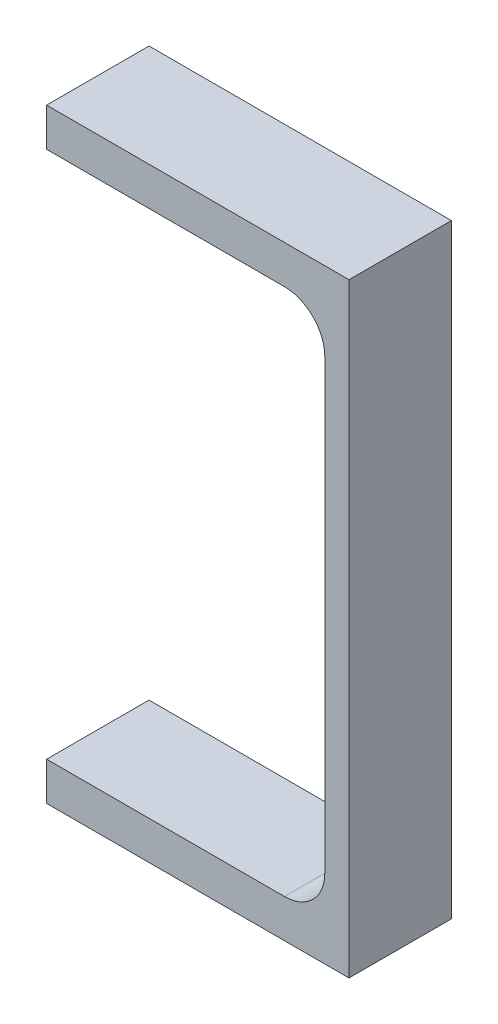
ISO-10303-21;
HEADER;
FILE_DESCRIPTION(('STEP AP214'),'2;1');
FILE_NAME('part.step','',(''),(''),'','','');
FILE_SCHEMA(('AUTOMOTIVE_DESIGN { 1 0 10303 214 1 1 1 1 }'));
ENDSEC;
DATA;
#1=APPLICATION_CONTEXT('core data for automotive mechanical design processes');
#2=APPLICATION_PROTOCOL_DEFINITION('international standard','automotive_design',2000,#1);
#3=PRODUCT_CONTEXT('',#1,'mechanical');
#4=PRODUCT('Part','Part','',(#3));
#5=PRODUCT_RELATED_PRODUCT_CATEGORY('part','',(#4));
#6=PRODUCT_DEFINITION_FORMATION('','',#4);
#7=PRODUCT_DEFINITION_CONTEXT('part definition',#1,'design');
#8=PRODUCT_DEFINITION('design','',#6,#7);
#9=PRODUCT_DEFINITION_SHAPE('','',#8);
#10=(LENGTH_UNIT() NAMED_UNIT(*) SI_UNIT(.MILLI.,.METRE.));
#11=(NAMED_UNIT(*) PLANE_ANGLE_UNIT() SI_UNIT($,.RADIAN.));
#12=(NAMED_UNIT(*) SI_UNIT($,.STERADIAN.) SOLID_ANGLE_UNIT());
#13=UNCERTAINTY_MEASURE_WITH_UNIT(LENGTH_MEASURE(1.E-05),#10,'distance_accuracy_value','');
#14=(GEOMETRIC_REPRESENTATION_CONTEXT(3) GLOBAL_UNCERTAINTY_ASSIGNED_CONTEXT((#13)) GLOBAL_UNIT_ASSIGNED_CONTEXT((#10,
#11,#12)) REPRESENTATION_CONTEXT('',''));
#15=CARTESIAN_POINT('',(0.,0.,0.));
#16=DIRECTION('',(0.,0.,1.));
#17=DIRECTION('',(1.,0.,0.));
#18=AXIS2_PLACEMENT_3D('',#15,#16,#17);
#19=CARTESIAN_POINT('',(-75.,75.,12.7));
#20=DIRECTION('',(1.,0.,0.));
#21=DIRECTION('',(0.,1.,0.));
#22=AXIS2_PLACEMENT_3D('',#19,#20,#21);
#23=PLANE('',#22);
#24=DIRECTION('',(0.,-1.,0.));
#25=VECTOR('',#24,1.);
#26=CARTESIAN_POINT('',(-75.,75.,-12.7));
#27=LINE('',#26,#25);
#28=CARTESIAN_POINT('',(-75.,75.,-12.7));
#29=VERTEX_POINT('',#28);
#30=CARTESIAN_POINT('',(-75.,65.5,-12.7));
#31=VERTEX_POINT('',#30);
#32=EDGE_CURVE('E141',#29,#31,#27,.T.);
#33=ORIENTED_EDGE('',*,*,#32,.T.);
#34=DIRECTION('',(0.,0.,-1.));
#35=VECTOR('',#34,1.);
#36=CARTESIAN_POINT('',(-75.,65.5,12.7));
#37=LINE('',#36,#35);
#38=CARTESIAN_POINT('',(-75.,65.5,12.7));
#39=VERTEX_POINT('',#38);
#40=EDGE_CURVE('E11',#39,#31,#37,.T.);
#41=ORIENTED_EDGE('',*,*,#40,.F.);
#42=DIRECTION('',(0.,-1.,0.));
#43=VECTOR('',#42,1.);
#44=CARTESIAN_POINT('',(-75.,75.,12.7));
#45=LINE('',#44,#43);
#46=CARTESIAN_POINT('',(-75.,75.,12.7));
#47=VERTEX_POINT('',#46);
#48=EDGE_CURVE('E159',#47,#39,#45,.T.);
#49=ORIENTED_EDGE('',*,*,#48,.F.);
#50=DIRECTION('',(0.,0.,-1.));
#51=VECTOR('',#50,1.);
#52=CARTESIAN_POINT('',(-75.,75.,12.7));
#53=LINE('',#52,#51);
#54=EDGE_CURVE('E137',#47,#29,#53,.T.);
#55=ORIENTED_EDGE('',*,*,#54,.T.);
#56=EDGE_LOOP('',(#33,#41,#49,#55));
#57=FACE_BOUND('',#56,.T.);
#58=ADVANCED_FACE('F33',(#57),#23,.F.);
#59=CARTESIAN_POINT('',(-75.,65.5,12.7));
#60=DIRECTION('',(0.,1.,0.));
#61=DIRECTION('',(-1.,0.,0.));
#62=AXIS2_PLACEMENT_3D('',#59,#60,#61);
#63=PLANE('',#62);
#64=DIRECTION('',(1.,0.,0.));
#65=VECTOR('',#64,1.);
#66=CARTESIAN_POINT('',(-75.,65.5,-12.7));
#67=LINE('',#66,#65);
#68=CARTESIAN_POINT('',(-16.,65.5,-12.7));
#69=VERTEX_POINT('',#68);
#70=EDGE_CURVE('E144',#31,#69,#67,.T.);
#71=ORIENTED_EDGE('',*,*,#70,.T.);
#72=DIRECTION('',(0.,0.,-1.));
#73=VECTOR('',#72,1.);
#74=CARTESIAN_POINT('',(-16.,65.5,12.7));
#75=LINE('',#74,#73);
#76=CARTESIAN_POINT('',(-16.,65.5,12.7));
#77=VERTEX_POINT('',#76);
#78=EDGE_CURVE('E41',#77,#69,#75,.T.);
#79=ORIENTED_EDGE('',*,*,#78,.F.);
#80=DIRECTION('',(1.,0.,0.));
#81=VECTOR('',#80,1.);
#82=CARTESIAN_POINT('',(-75.,65.5,12.7));
#83=LINE('',#82,#81);
#84=EDGE_CURVE('E98',#39,#77,#83,.T.);
#85=ORIENTED_EDGE('',*,*,#84,.F.);
#86=ORIENTED_EDGE('',*,*,#40,.T.);
#87=EDGE_LOOP('',(#71,#79,#85,#86));
#88=FACE_BOUND('',#87,.T.);
#89=ADVANCED_FACE('F208',(#88),#63,.F.);
#90=CARTESIAN_POINT('',(-16.,55.5,12.7));
#91=DIRECTION('',(0.,0.,-1.));
#92=DIRECTION('',(-1.,0.,0.));
#93=AXIS2_PLACEMENT_3D('',#90,#91,#92);
#94=CYLINDRICAL_SURFACE('',#93,10.);
#95=CARTESIAN_POINT('',(-16.,55.5,-12.7));
#96=DIRECTION('',(0.,0.,-1.));
#97=DIRECTION('',(-1.,0.,0.));
#98=AXIS2_PLACEMENT_3D('',#95,#96,#97);
#99=CIRCLE('',#98,10.);
#100=CARTESIAN_POINT('',(-5.99999999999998,55.5,-12.7));
#101=VERTEX_POINT('',#100);
#102=EDGE_CURVE('E146',#69,#101,#99,.T.);
#103=ORIENTED_EDGE('',*,*,#102,.T.);
#104=DIRECTION('',(0.,0.,-1.));
#105=VECTOR('',#104,1.);
#106=CARTESIAN_POINT('',(-5.99999999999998,55.5,12.7));
#107=LINE('',#106,#105);
#108=CARTESIAN_POINT('',(-5.99999999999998,55.5,12.7));
#109=VERTEX_POINT('',#108);
#110=EDGE_CURVE('E172',#109,#101,#107,.T.);
#111=ORIENTED_EDGE('',*,*,#110,.F.);
#112=CARTESIAN_POINT('',(-16.,55.5,12.7));
#113=DIRECTION('',(0.,0.,-1.));
#114=DIRECTION('',(-1.,0.,0.));
#115=AXIS2_PLACEMENT_3D('',#112,#113,#114);
#116=CIRCLE('',#115,10.);
#117=EDGE_CURVE('E180',#77,#109,#116,.T.);
#118=ORIENTED_EDGE('',*,*,#117,.F.);
#119=ORIENTED_EDGE('',*,*,#78,.T.);
#120=EDGE_LOOP('',(#103,#111,#118,#119));
#121=FACE_BOUND('',#120,.T.);
#122=ADVANCED_FACE('F178',(#121),#94,.F.);
#123=CARTESIAN_POINT('',(-5.99999999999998,55.5,12.7));
#124=DIRECTION('',(1.,0.,0.));
#125=DIRECTION('',(0.,0.,-1.));
#126=AXIS2_PLACEMENT_3D('',#123,#124,#125);
#127=PLANE('',#126);
#128=DIRECTION('',(0.,-1.,0.));
#129=VECTOR('',#128,1.);
#130=CARTESIAN_POINT('',(-5.99999999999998,55.5,-12.7));
#131=LINE('',#130,#129);
#132=CARTESIAN_POINT('',(-5.99999999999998,-55.5,-12.7));
#133=VERTEX_POINT('',#132);
#134=EDGE_CURVE('E148',#101,#133,#131,.T.);
#135=ORIENTED_EDGE('',*,*,#134,.T.);
#136=DIRECTION('',(0.,0.,-1.));
#137=VECTOR('',#136,1.);
#138=CARTESIAN_POINT('',(-5.99999999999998,-55.5,12.7));
#139=LINE('',#138,#137);
#140=CARTESIAN_POINT('',(-5.99999999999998,-55.5,12.7));
#141=VERTEX_POINT('',#140);
#142=EDGE_CURVE('E169',#141,#133,#139,.T.);
#143=ORIENTED_EDGE('',*,*,#142,.F.);
#144=DIRECTION('',(0.,-1.,0.));
#145=VECTOR('',#144,1.);
#146=CARTESIAN_POINT('',(-5.99999999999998,55.5,12.7));
#147=LINE('',#146,#145);
#148=EDGE_CURVE('E198',#109,#141,#147,.T.);
#149=ORIENTED_EDGE('',*,*,#148,.F.);
#150=ORIENTED_EDGE('',*,*,#110,.T.);
#151=EDGE_LOOP('',(#135,#143,#149,#150));
#152=FACE_BOUND('',#151,.T.);
#153=ADVANCED_FACE('F189',(#152),#127,.F.);
#154=CARTESIAN_POINT('',(-16.,-55.5,12.7));
#155=DIRECTION('',(0.,0.,-1.));
#156=DIRECTION('',(-1.,0.,0.));
#157=AXIS2_PLACEMENT_3D('',#154,#155,#156);
#158=CYLINDRICAL_SURFACE('',#157,10.);
#159=CARTESIAN_POINT('',(-16.,-55.5,-12.7));
#160=DIRECTION('',(0.,0.,-1.));
#161=DIRECTION('',(1.,0.,0.));
#162=AXIS2_PLACEMENT_3D('',#159,#160,#161);
#163=CIRCLE('',#162,10.);
#164=CARTESIAN_POINT('',(-16.,-65.5,-12.7));
#165=VERTEX_POINT('',#164);
#166=EDGE_CURVE('E150',#133,#165,#163,.T.);
#167=ORIENTED_EDGE('',*,*,#166,.T.);
#168=DIRECTION('',(0.,0.,-1.));
#169=VECTOR('',#168,1.);
#170=CARTESIAN_POINT('',(-16.,-65.5,12.7));
#171=LINE('',#170,#169);
#172=CARTESIAN_POINT('',(-16.,-65.5,12.7));
#173=VERTEX_POINT('',#172);
#174=EDGE_CURVE('E166',#173,#165,#171,.T.);
#175=ORIENTED_EDGE('',*,*,#174,.F.);
#176=CARTESIAN_POINT('',(-16.,-55.5,12.7));
#177=DIRECTION('',(0.,0.,-1.));
#178=DIRECTION('',(1.,0.,0.));
#179=AXIS2_PLACEMENT_3D('',#176,#177,#178);
#180=CIRCLE('',#179,10.);
#181=EDGE_CURVE('E195',#141,#173,#180,.T.);
#182=ORIENTED_EDGE('',*,*,#181,.F.);
#183=ORIENTED_EDGE('',*,*,#142,.T.);
#184=EDGE_LOOP('',(#167,#175,#182,#183));
#185=FACE_BOUND('',#184,.T.);
#186=ADVANCED_FACE('F193',(#185),#158,.F.);
#187=CARTESIAN_POINT('',(-75.,-65.5,12.7));
#188=DIRECTION('',(0.,-1.,0.));
#189=DIRECTION('',(1.,0.,0.));
#190=AXIS2_PLACEMENT_3D('',#187,#188,#189);
#191=PLANE('',#190);
#192=DIRECTION('',(-1.,0.,0.));
#193=VECTOR('',#192,1.);
#194=CARTESIAN_POINT('',(-75.,-65.5,-12.7));
#195=LINE('',#194,#193);
#196=CARTESIAN_POINT('',(-75.,-65.5,-12.7));
#197=VERTEX_POINT('',#196);
#198=EDGE_CURVE('E152',#165,#197,#195,.T.);
#199=ORIENTED_EDGE('',*,*,#198,.T.);
#200=DIRECTION('',(0.,0.,-1.));
#201=VECTOR('',#200,1.);
#202=CARTESIAN_POINT('',(-75.,-65.5,12.7));
#203=LINE('',#202,#201);
#204=CARTESIAN_POINT('',(-75.,-65.5,12.7));
#205=VERTEX_POINT('',#204);
#206=EDGE_CURVE('E163',#205,#197,#203,.T.);
#207=ORIENTED_EDGE('',*,*,#206,.F.);
#208=DIRECTION('',(-1.,0.,0.));
#209=VECTOR('',#208,1.);
#210=CARTESIAN_POINT('',(-75.,-65.5,12.7));
#211=LINE('',#210,#209);
#212=EDGE_CURVE('E197',#173,#205,#211,.T.);
#213=ORIENTED_EDGE('',*,*,#212,.F.);
#214=ORIENTED_EDGE('',*,*,#174,.T.);
#215=EDGE_LOOP('',(#199,#207,#213,#214));
#216=FACE_BOUND('',#215,.T.);
#217=ADVANCED_FACE('F220',(#216),#191,.F.);
#218=CARTESIAN_POINT('',(-75.,-65.5,12.7));
#219=DIRECTION('',(1.,0.,0.));
#220=DIRECTION('',(0.,1.,0.));
#221=AXIS2_PLACEMENT_3D('',#218,#219,#220);
#222=PLANE('',#221);
#223=DIRECTION('',(0.,-1.,0.));
#224=VECTOR('',#223,1.);
#225=CARTESIAN_POINT('',(-75.,-65.5,-12.7));
#226=LINE('',#225,#224);
#227=CARTESIAN_POINT('',(-75.,-75.,-12.7));
#228=VERTEX_POINT('',#227);
#229=EDGE_CURVE('E154',#197,#228,#226,.T.);
#230=ORIENTED_EDGE('',*,*,#229,.T.);
#231=DIRECTION('',(0.,0.,-1.));
#232=VECTOR('',#231,1.);
#233=CARTESIAN_POINT('',(-75.,-75.,12.7));
#234=LINE('',#233,#232);
#235=CARTESIAN_POINT('',(-75.,-75.,12.7));
#236=VERTEX_POINT('',#235);
#237=EDGE_CURVE('E132',#236,#228,#234,.T.);
#238=ORIENTED_EDGE('',*,*,#237,.F.);
#239=DIRECTION('',(0.,-1.,0.));
#240=VECTOR('',#239,1.);
#241=CARTESIAN_POINT('',(-75.,-65.5,12.7));
#242=LINE('',#241,#240);
#243=EDGE_CURVE('E123',#205,#236,#242,.T.);
#244=ORIENTED_EDGE('',*,*,#243,.F.);
#245=ORIENTED_EDGE('',*,*,#206,.T.);
#246=EDGE_LOOP('',(#230,#238,#244,#245));
#247=FACE_BOUND('',#246,.T.);
#248=ADVANCED_FACE('F223',(#247),#222,.F.);
#249=CARTESIAN_POINT('',(-75.,-75.,12.7));
#250=DIRECTION('',(0.,1.,0.));
#251=DIRECTION('',(-1.,0.,0.));
#252=AXIS2_PLACEMENT_3D('',#249,#250,#251);
#253=PLANE('',#252);
#254=DIRECTION('',(1.,0.,0.));
#255=VECTOR('',#254,1.);
#256=CARTESIAN_POINT('',(-75.,-75.,-12.7));
#257=LINE('',#256,#255);
#258=CARTESIAN_POINT('',(0.,-75.,-12.7));
#259=VERTEX_POINT('',#258);
#260=EDGE_CURVE('E131',#228,#259,#257,.T.);
#261=ORIENTED_EDGE('',*,*,#260,.T.);
#262=DIRECTION('',(0.,0.,-1.));
#263=VECTOR('',#262,1.);
#264=CARTESIAN_POINT('',(0.,-75.,12.7));
#265=LINE('',#264,#263);
#266=CARTESIAN_POINT('',(0.,-75.,12.7));
#267=VERTEX_POINT('',#266);
#268=EDGE_CURVE('E128',#267,#259,#265,.T.);
#269=ORIENTED_EDGE('',*,*,#268,.F.);
#270=DIRECTION('',(1.,0.,0.));
#271=VECTOR('',#270,1.);
#272=CARTESIAN_POINT('',(-75.,-75.,12.7));
#273=LINE('',#272,#271);
#274=EDGE_CURVE('E117',#236,#267,#273,.T.);
#275=ORIENTED_EDGE('',*,*,#274,.F.);
#276=ORIENTED_EDGE('',*,*,#237,.T.);
#277=EDGE_LOOP('',(#261,#269,#275,#276));
#278=FACE_BOUND('',#277,.T.);
#279=ADVANCED_FACE('F129',(#278),#253,.F.);
#280=CARTESIAN_POINT('',(0.,75.,12.7));
#281=DIRECTION('',(-1.,0.,0.));
#282=DIRECTION('',(0.,0.,1.));
#283=AXIS2_PLACEMENT_3D('',#280,#281,#282);
#284=PLANE('',#283);
#285=DIRECTION('',(0.,1.,0.));
#286=VECTOR('',#285,1.);
#287=CARTESIAN_POINT('',(0.,75.,-12.7));
#288=LINE('',#287,#286);
#289=CARTESIAN_POINT('',(0.,75.,-12.7));
#290=VERTEX_POINT('',#289);
#291=EDGE_CURVE('E84',#259,#290,#288,.T.);
#292=ORIENTED_EDGE('',*,*,#291,.T.);
#293=DIRECTION('',(0.,0.,-1.));
#294=VECTOR('',#293,1.);
#295=CARTESIAN_POINT('',(0.,75.,12.7));
#296=LINE('',#295,#294);
#297=CARTESIAN_POINT('',(0.,75.,12.7));
#298=VERTEX_POINT('',#297);
#299=EDGE_CURVE('E133',#298,#290,#296,.T.);
#300=ORIENTED_EDGE('',*,*,#299,.F.);
#301=DIRECTION('',(0.,1.,0.));
#302=VECTOR('',#301,1.);
#303=CARTESIAN_POINT('',(0.,75.,12.7));
#304=LINE('',#303,#302);
#305=EDGE_CURVE('E121',#267,#298,#304,.T.);
#306=ORIENTED_EDGE('',*,*,#305,.F.);
#307=ORIENTED_EDGE('',*,*,#268,.T.);
#308=EDGE_LOOP('',(#292,#300,#306,#307));
#309=FACE_BOUND('',#308,.T.);
#310=ADVANCED_FACE('F135',(#309),#284,.F.);
#311=CARTESIAN_POINT('',(-75.,75.,12.7));
#312=DIRECTION('',(0.,-1.,0.));
#313=DIRECTION('',(1.,0.,0.));
#314=AXIS2_PLACEMENT_3D('',#311,#312,#313);
#315=PLANE('',#314);
#316=DIRECTION('',(-1.,0.,0.));
#317=VECTOR('',#316,1.);
#318=CARTESIAN_POINT('',(-75.,75.,-12.7));
#319=LINE('',#318,#317);
#320=EDGE_CURVE('E90',#290,#29,#319,.T.);
#321=ORIENTED_EDGE('',*,*,#320,.T.);
#322=ORIENTED_EDGE('',*,*,#54,.F.);
#323=DIRECTION('',(-1.,0.,0.));
#324=VECTOR('',#323,1.);
#325=CARTESIAN_POINT('',(-75.,75.,12.7));
#326=LINE('',#325,#324);
#327=EDGE_CURVE('E49',#298,#47,#326,.T.);
#328=ORIENTED_EDGE('',*,*,#327,.F.);
#329=ORIENTED_EDGE('',*,*,#299,.T.);
#330=EDGE_LOOP('',(#321,#322,#328,#329));
#331=FACE_BOUND('',#330,.T.);
#332=ADVANCED_FACE('F232',(#331),#315,.F.);
#333=CARTESIAN_POINT('',(-16.,55.5,12.7));
#334=DIRECTION('',(0.,0.,-1.));
#335=DIRECTION('',(-1.,0.,0.));
#336=AXIS2_PLACEMENT_3D('',#333,#334,#335);
#337=PLANE('',#336);
#338=ORIENTED_EDGE('',*,*,#48,.T.);
#339=ORIENTED_EDGE('',*,*,#84,.T.);
#340=ORIENTED_EDGE('',*,*,#117,.T.);
#341=ORIENTED_EDGE('',*,*,#148,.T.);
#342=ORIENTED_EDGE('',*,*,#181,.T.);
#343=ORIENTED_EDGE('',*,*,#212,.T.);
#344=ORIENTED_EDGE('',*,*,#243,.T.);
#345=ORIENTED_EDGE('',*,*,#274,.T.);
#346=ORIENTED_EDGE('',*,*,#305,.T.);
#347=ORIENTED_EDGE('',*,*,#327,.T.);
#348=EDGE_LOOP('',(#338,#339,#340,#341,#342,#343,#344,#345,#346,#347));
#349=FACE_BOUND('',#348,.T.);
#350=ADVANCED_FACE('F119',(#349),#337,.F.);
#351=CARTESIAN_POINT('',(-16.,55.5,-12.7));
#352=DIRECTION('',(0.,0.,-1.));
#353=DIRECTION('',(-1.,0.,0.));
#354=AXIS2_PLACEMENT_3D('',#351,#352,#353);
#355=PLANE('',#354);
#356=ORIENTED_EDGE('',*,*,#32,.F.);
#357=ORIENTED_EDGE('',*,*,#320,.F.);
#358=ORIENTED_EDGE('',*,*,#291,.F.);
#359=ORIENTED_EDGE('',*,*,#260,.F.);
#360=ORIENTED_EDGE('',*,*,#229,.F.);
#361=ORIENTED_EDGE('',*,*,#198,.F.);
#362=ORIENTED_EDGE('',*,*,#166,.F.);
#363=ORIENTED_EDGE('',*,*,#134,.F.);
#364=ORIENTED_EDGE('',*,*,#102,.F.);
#365=ORIENTED_EDGE('',*,*,#70,.F.);
#366=EDGE_LOOP('',(#356,#357,#358,#359,#360,#361,#362,#363,#364,#365));
#367=FACE_BOUND('',#366,.T.);
#368=ADVANCED_FACE('F184',(#367),#355,.T.);
#369=CLOSED_SHELL('',(#58,#89,#122,#153,#186,#217,#248,#279,#310,#332,#350,#368));
#370=MANIFOLD_SOLID_BREP('B2',#369);
#371=ADVANCED_BREP_SHAPE_REPRESENTATION('',(#18,#370),#14);
#372=SHAPE_DEFINITION_REPRESENTATION(#9,#371);
ENDSEC;
END-ISO-10303-21;
